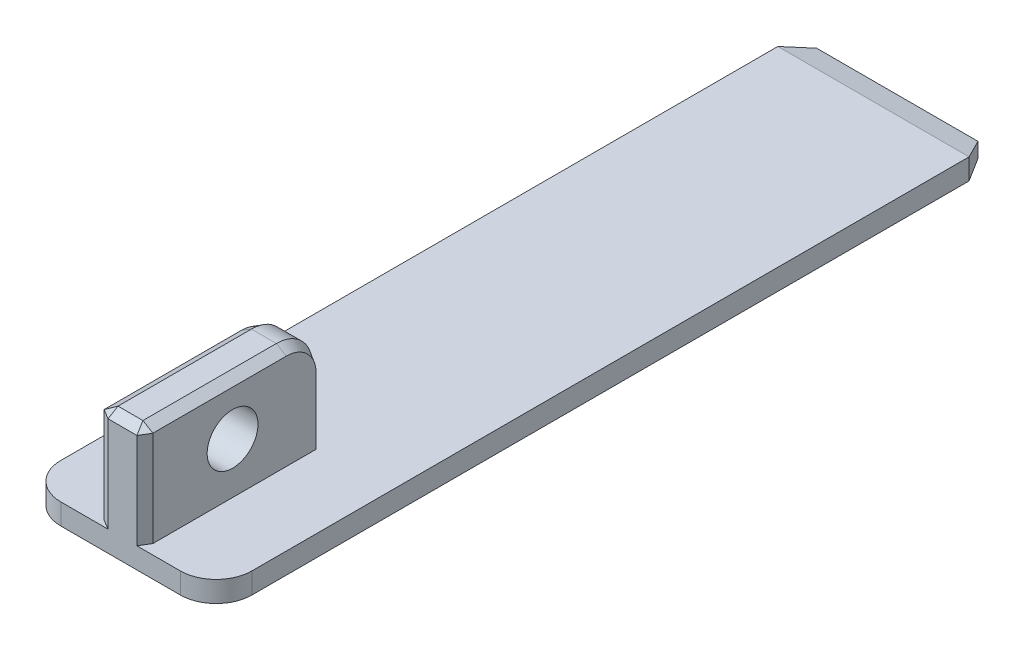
from build123d import *
from OCP.BRepFilletAPI import BRepFilletAPI_MakeChamfer

# Parameters (mm, degrees)
SKIZZE1_W                       = 32
SKIZZE1_H                       = 3.5
AUFSATZ_LINEAR_AUSTRAGEN1_DEPTH = 130
FASE1_SIZE                      = 2.5
FASE1_SIZE2                     = 4
FASE2_SIZE                      = 1
FASE2_SIZE2                     = 4
SKIZZE2_W                       = 7.5
SKIZZE2_H                       = 30
AUFSATZ_LINEAR_AUSTRAGEN2_DEPTH = 17
SKIZZE3_R                       = 4.25
SCHNITT_LINEAR_AUSTRAGEN1_DEPTH = 133.821779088
VERRUNDUNG1_R                   = 6
VERRUNDUNG2_R                   = 6
FASE3_SIZE                      = 1
FASE3_SIZE2                     = 1.664279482


with BuildPart() as part:
    # Skizze1 → Aufsatz-Linear austragen1 (new body)
    with BuildSketch(Plane.XY):
        Rectangle(SKIZZE1_W, SKIZZE1_H)
    extrude(amount=AUFSATZ_LINEAR_AUSTRAGEN1_DEPTH)

    # Fase1
    fase1_edges = [part.edges().sort_by_distance(p)[0] for p in [
        (-16, 0, 0),
        (16, 0, 0),
    ]]
    fase1_side = [part.faces().sort_by_distance(p)[0] for p in [
        (0, 0, 0),
    ]]
    chamfer(fase1_edges, length=FASE1_SIZE, length2=FASE1_SIZE2, reference=fase1_side[0])

    # Fase2
    fase2_edges = [part.edges().sort_by_distance(p)[0] for p in [
        (0, 1.75, 0),
    ]]
    fase2_side = [part.faces().sort_by_distance(p)[0] for p in [
        (0, 0, 0),
    ]]
    chamfer(fase2_edges, length=FASE2_SIZE, length2=FASE2_SIZE2, reference=fase2_side[0])

    # Skizze2 → Aufsatz-Linear austragen2 (add)
    with BuildSketch(Plane(origin=(0, 1.75, 0), x_dir=(1, 0, 0), z_dir=(0, 1, 0))):
        with Locations((0, -115)):
            Rectangle(SKIZZE2_W, SKIZZE2_H)
    extrude(amount=AUFSATZ_LINEAR_AUSTRAGEN2_DEPTH)

    # Skizze3 → Schnitt-Linear austragen1 (cut, through all)
    with BuildSketch(Plane(origin=(3.75, 0, 0), x_dir=(0, 0, -1), z_dir=(1, 0, 0))):
        with Locations((-115, 10.25)):
            Circle(SKIZZE3_R)
    extrude(amount=-SCHNITT_LINEAR_AUSTRAGEN1_DEPTH, mode=Mode.SUBTRACT)

    # Verrundung1
    verrundung1_edges = [part.edges().sort_by_distance(p)[0] for p in [
        (0, 18.75, 100),
    ]]
    fillet(verrundung1_edges, radius=VERRUNDUNG1_R)

    # Verrundung2
    verrundung2_edges = [part.edges().sort_by_distance(p)[0] for p in [
        (-16, 0, 130),
        (16, 0, 130),
    ]]
    fillet(verrundung2_edges, radius=VERRUNDUNG2_R)

    # Fase3: one chamfer whose edges measure the first distance from different faces: ONE call of the kernel's chamfer builder (chamfer() names one face for all edges)
    fase3_edges_1 = [part.edges().sort_by_distance(p)[0] for p in [
        (-3.75, 10.25, 130),
        (-3.75, 18.75, 118),
        (-3.75, 7.25, 100),
        (-3.75, 16.992640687, 101.757359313),
    ]]
    fase3_side_1 = [part.faces().sort_by_distance(p)[0] for p in [
        (-3.75, 18.405181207, 118),
    ]]
    fase3_edges_2 = [part.edges().sort_by_distance(p)[0] for p in [
        (3.75, 10.25, 130),
        (0, 18.75, 130),
    ]]
    fase3_side_2 = [part.faces().sort_by_distance(p)[0] for p in [
        (0, 6.617088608, 130),
    ]]
    fase3_edges_3 = [part.edges().sort_by_distance(p)[0] for p in [
        (3.75, 18.75, 118),
        (3.75, 7.25, 100),
        (3.75, 16.992640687, 101.757359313),
    ]]
    fase3_side_3 = [part.faces().sort_by_distance(p)[0] for p in [
        (3.75, 7.25, 100.344818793),
    ]]
    fase3 = BRepFilletAPI_MakeChamfer(part.part.solid().wrapped)
    for e in fase3_edges_1:
        fase3.Add(FASE3_SIZE, FASE3_SIZE2, e.wrapped, fase3_side_1[0].wrapped)  # the first distance lies on this face
    for e in fase3_edges_2:
        fase3.Add(FASE3_SIZE, FASE3_SIZE2, e.wrapped, fase3_side_2[0].wrapped)  # the first distance lies on this face
    for e in fase3_edges_3:
        fase3.Add(FASE3_SIZE, FASE3_SIZE2, e.wrapped, fase3_side_3[0].wrapped)  # the first distance lies on this face
    add(Compound.cast(fase3.Shape()), mode=Mode.REPLACE)


solid = part.part
